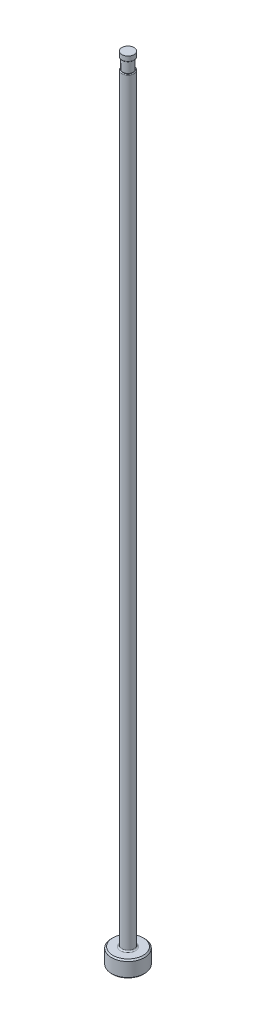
from build123d import *

# Parameters (mm, degrees)
CHAMFER1_SIZE     = 0.254
FILLET1_R         = 0.254
SKETCH2_W         = 0.2032
SKETCH2_H         = 2.032
D_SLOT_DEPTH      = 153.466131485
D_SLOT_DEPTH_BACK = 153.466131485
SKETCH5_W         = 0.00508
SKETCH5_H         = 1.016
FILLET2_R         = 0.127


with BuildPart() as part:
    # Sketch1 → Revolve1 (revolve)
    with BuildSketch(Plane.XY, mode=Mode.PRIVATE) as revolve1_sk:
        Polygon((0, 0), (-3.175, 0), (-3.175, 3.175), (-1.18999, 3.175), (-1.18999, 152.4), (0, 152.4), align=None)
    revolve(revolve1_sk.sketch.rotate(Axis((0, 259.958771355, 0), (0, -1, 0)), 270), axis=Axis((0, 259.958771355, 0), (0, -1, 0)))

    # Chamfer1
    chamfer1_edges = [part.edges().sort_by_distance(p)[0] for p in [
        (0, 3.175, -3.175),
        (0, 0, -3.175),
    ]]
    chamfer(chamfer1_edges, length=CHAMFER1_SIZE)

    # Fillet1
    fillet1_edges = [part.edges().sort_by_distance(p)[0] for p in [
        (0, 3.175, -1.18999),
    ]]
    fillet(fillet1_edges, radius=FILLET1_R)

    # Sketch2 → Vent Relief (revolve, cut)
    with BuildSketch(Plane.XY, mode=Mode.PRIVATE) as vent_relief_sk:
        with Locations((-1.08839, 150.368)):
            Rectangle(SKETCH2_W, SKETCH2_H)
    revolve(vent_relief_sk.sketch.rotate(Axis((0, 153.448281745, 0), (0, -1, 0)), 270), axis=Axis((0, 153.448281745, 0), (0, -1, 0)), mode=Mode.SUBTRACT)

    # Sketch3 → D-Slot (cut, two sides: drawn at the far end of the back side and taken through both)
    with BuildSketch(Plane.XY.offset(-D_SLOT_DEPTH_BACK)):
        with BuildLine():
            Line((-0.98679, 150.368), (-0.98679, 86.868))
            ThreePointArc((-0.98679, 86.868), (-1.038003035, 86.300038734), (-1.18999, 85.7504))
            Line((-1.18999, 85.7504), (-1.18999, 150.368))
            Line((-1.18999, 150.368), (-0.98679, 150.368))
        make_face()
    extrude(amount=D_SLOT_DEPTH + D_SLOT_DEPTH_BACK, mode=Mode.SUBTRACT)

    # Sketch5 → Vent Diameter (revolve, cut)
    with BuildSketch(Plane.XY, mode=Mode.PRIVATE) as vent_diameter_sk:
        with Locations((-1.18745, 151.892)):
            Rectangle(SKETCH5_W, SKETCH5_H)
    revolve(vent_diameter_sk.sketch.rotate(Axis((0, 152.687735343, 0), (0, -1, 0)), 90), axis=Axis((0, 152.687735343, 0), (0, -1, 0)), mode=Mode.SUBTRACT)

    # Fillet2
    fillet2_edges = [part.edges().sort_by_distance(p)[0] for p in [
        (1.050596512, 149.352, -0.55885881),
        (0, 151.384, 1.18491),
    ]]
    fillet(fillet2_edges, radius=FILLET2_R)


solid = part.part
